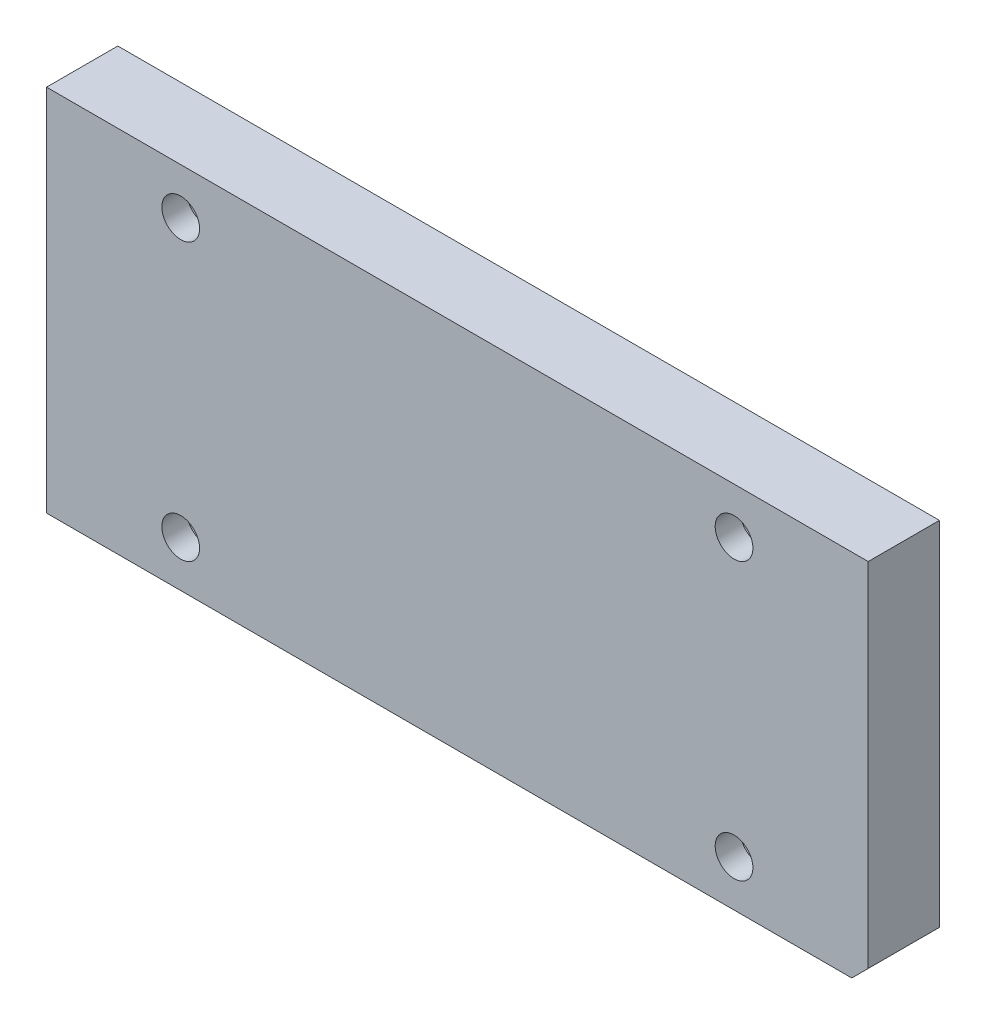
from build123d import *

# Parameters (mm, degrees)
SKETCH1_W                = 196
SKETCH1_H                = 88
BOSS_EXTRUDE1_DEPTH      = 17
HOLE1_D                  = 9
HOLE1_CBORE_D            = 15
HOLE1_CBORE_DEPTH        = 11
TAPPED_HOLE1_D           = 3.3
TAPPED_HOLE1_DEPTH       = 11.008579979
TAPPED_HOLE1_CBORE_D     = 4
TAPPED_HOLE1_CBORE_DEPTH = 7
TAPPED_HOLE1_TIP         = 0.991420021
CHAMFER1_SIZE            = 3.92


with BuildPart() as part:
    # Sketch1 → Boss-Extrude1 (new body)
    with BuildSketch(Plane.XY):
        Rectangle(SKETCH1_W, SKETCH1_H)
    extrude(amount=-BOSS_EXTRUDE1_DEPTH)

    # Hole1 (through all)
    with Locations(Plane(origin=(0, 0, -17), x_dir=(1, 0, 0), z_dir=(0, 0, -1))):
        with Locations((66, -33), (66, 33), (-66, 33), (-66, -33)):
            CounterBoreHole(HOLE1_D / 2, HOLE1_CBORE_D / 2, HOLE1_CBORE_DEPTH)

    # Tapped Hole1
    with Locations(Plane(origin=(522.991452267, 0, -17), x_dir=(-1, 0, 0), z_dir=(0, 0, -1))):
        with Locations((439.991452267, 33), (439.991452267, -33), (605.991452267, -33), (605.991452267, 33)):
            CounterBoreHole(TAPPED_HOLE1_D / 2, TAPPED_HOLE1_CBORE_D / 2, TAPPED_HOLE1_CBORE_DEPTH, depth=TAPPED_HOLE1_DEPTH)
            with Locations((0, 0, -(TAPPED_HOLE1_DEPTH + TAPPED_HOLE1_TIP / 2))):  # 118° drill point
                Cone(0, TAPPED_HOLE1_D / 2, TAPPED_HOLE1_TIP, mode=Mode.SUBTRACT)

    # Chamfer1
    chamfer1_edges = [part.edges().sort_by_distance(p)[0] for p in [
        (98, -44, -8.5),
    ]]
    chamfer(chamfer1_edges, length=CHAMFER1_SIZE)


solid = part.part
